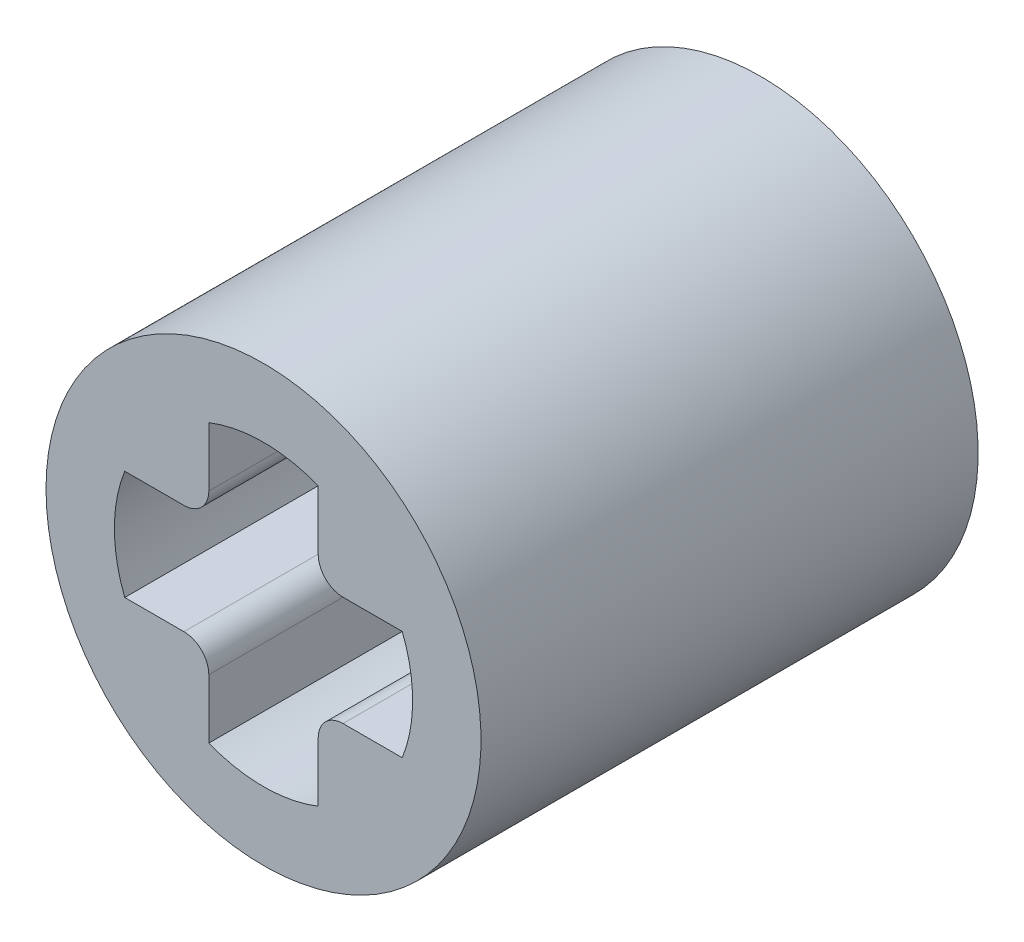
ISO-10303-21;
HEADER;
FILE_DESCRIPTION(('STEP AP214'),'2;1');
FILE_NAME('part.step','',(''),(''),'','','');
FILE_SCHEMA(('AUTOMOTIVE_DESIGN { 1 0 10303 214 1 1 1 1 }'));
ENDSEC;
DATA;
#1=APPLICATION_CONTEXT('core data for automotive mechanical design processes');
#2=APPLICATION_PROTOCOL_DEFINITION('international standard','automotive_design',2000,#1);
#3=PRODUCT_CONTEXT('',#1,'mechanical');
#4=PRODUCT('Part','Part','',(#3));
#5=PRODUCT_RELATED_PRODUCT_CATEGORY('part','',(#4));
#6=PRODUCT_DEFINITION_FORMATION('','',#4);
#7=PRODUCT_DEFINITION_CONTEXT('part definition',#1,'design');
#8=PRODUCT_DEFINITION('design','',#6,#7);
#9=PRODUCT_DEFINITION_SHAPE('','',#8);
#10=(LENGTH_UNIT() NAMED_UNIT(*) SI_UNIT(.MILLI.,.METRE.));
#11=(NAMED_UNIT(*) PLANE_ANGLE_UNIT() SI_UNIT($,.RADIAN.));
#12=(NAMED_UNIT(*) SI_UNIT($,.STERADIAN.) SOLID_ANGLE_UNIT());
#13=UNCERTAINTY_MEASURE_WITH_UNIT(LENGTH_MEASURE(1.E-05),#10,'distance_accuracy_value','');
#14=(GEOMETRIC_REPRESENTATION_CONTEXT(3) GLOBAL_UNCERTAINTY_ASSIGNED_CONTEXT((#13)) GLOBAL_UNIT_ASSIGNED_CONTEXT((#10,
#11,#12)) REPRESENTATION_CONTEXT('',''));
#15=CARTESIAN_POINT('',(0.,0.,0.));
#16=DIRECTION('',(0.,0.,1.));
#17=DIRECTION('',(1.,0.,0.));
#18=AXIS2_PLACEMENT_3D('',#15,#16,#17);
#19=CARTESIAN_POINT('',(-1.99133795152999,0.54112618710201,8.));
#20=DIRECTION('',(0.,0.,-1.));
#21=DIRECTION('',(-1.,0.,0.));
#22=AXIS2_PLACEMENT_3D('',#19,#20,#21);
#23=CYLINDRICAL_SURFACE('',#22,2.4);
#24=CARTESIAN_POINT('',(-1.99133795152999,0.54112618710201,8.));
#25=DIRECTION('',(0.,0.,-1.));
#26=DIRECTION('',(-1.,0.,0.));
#27=AXIS2_PLACEMENT_3D('',#24,#25,#26);
#28=CIRCLE('',#27,2.4);
#29=CARTESIAN_POINT('',(-4.22418366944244,-0.33887381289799,8.));
#30=VERTEX_POINT('',#29);
#31=CARTESIAN_POINT('',(-4.22418366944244,1.42112618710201,8.));
#32=VERTEX_POINT('',#31);
#33=EDGE_CURVE('E127',#30,#32,#28,.T.);
#34=ORIENTED_EDGE('',*,*,#33,.F.);
#35=DIRECTION('',(0.,0.,1.));
#36=VECTOR('',#35,1.);
#37=CARTESIAN_POINT('',(-4.22418366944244,-0.33887381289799,8.));
#38=LINE('',#37,#36);
#39=CARTESIAN_POINT('',(-4.22418366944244,-0.33887381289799,0.));
#40=VERTEX_POINT('',#39);
#41=EDGE_CURVE('E141',#40,#30,#38,.T.);
#42=ORIENTED_EDGE('',*,*,#41,.F.);
#43=CARTESIAN_POINT('',(-1.99133795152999,0.54112618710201,0.));
#44=DIRECTION('',(0.,0.,-1.));
#45=DIRECTION('',(-1.,0.,0.));
#46=AXIS2_PLACEMENT_3D('',#43,#44,#45);
#47=CIRCLE('',#46,2.4);
#48=CARTESIAN_POINT('',(-4.22418366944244,1.42112618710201,0.));
#49=VERTEX_POINT('',#48);
#50=EDGE_CURVE('E20',#49,#40,#47,.F.);
#51=ORIENTED_EDGE('',*,*,#50,.F.);
#52=DIRECTION('',(0.,0.,1.));
#53=VECTOR('',#52,1.);
#54=CARTESIAN_POINT('',(-4.22418366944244,1.42112618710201,8.));
#55=LINE('',#54,#53);
#56=EDGE_CURVE('E153',#32,#49,#55,.F.);
#57=ORIENTED_EDGE('',*,*,#56,.F.);
#58=EDGE_LOOP('',(#34,#42,#51,#57));
#59=FACE_BOUND('',#58,.T.);
#60=ADVANCED_FACE('F17',(#59),#23,.F.);
#61=CARTESIAN_POINT('',(-4.22418366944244,-0.33887381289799,8.));
#62=DIRECTION('',(0.,1.,0.));
#63=DIRECTION('',(-1.,0.,0.));
#64=AXIS2_PLACEMENT_3D('',#61,#62,#63);
#65=PLANE('',#64);
#66=DIRECTION('',(-1.,0.,0.));
#67=VECTOR('',#66,1.);
#68=CARTESIAN_POINT('',(-4.22418366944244,-0.33887381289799,8.));
#69=LINE('',#68,#67);
#70=CARTESIAN_POINT('',(-3.27133795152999,-0.33887381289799,8.));
#71=VERTEX_POINT('',#70);
#72=EDGE_CURVE('E143',#30,#71,#69,.F.);
#73=ORIENTED_EDGE('',*,*,#72,.T.);
#74=DIRECTION('',(0.,0.,-1.));
#75=VECTOR('',#74,1.);
#76=CARTESIAN_POINT('',(-3.27133795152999,-0.33887381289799,8.));
#77=LINE('',#76,#75);
#78=CARTESIAN_POINT('',(-3.27133795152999,-0.33887381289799,0.));
#79=VERTEX_POINT('',#78);
#80=EDGE_CURVE('E147',#79,#71,#77,.F.);
#81=ORIENTED_EDGE('',*,*,#80,.F.);
#82=DIRECTION('',(-1.,0.,0.));
#83=VECTOR('',#82,1.);
#84=CARTESIAN_POINT('',(-4.22418366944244,-0.33887381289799,0.));
#85=LINE('',#84,#83);
#86=EDGE_CURVE('E135',#79,#40,#85,.T.);
#87=ORIENTED_EDGE('',*,*,#86,.T.);
#88=ORIENTED_EDGE('',*,*,#41,.T.);
#89=EDGE_LOOP('',(#73,#81,#87,#88));
#90=FACE_BOUND('',#89,.T.);
#91=ADVANCED_FACE('F145',(#90),#65,.T.);
#92=CARTESIAN_POINT('',(-3.27133795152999,1.42112618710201,8.));
#93=DIRECTION('',(0.,-1.,0.));
#94=DIRECTION('',(1.,0.,0.));
#95=AXIS2_PLACEMENT_3D('',#92,#93,#94);
#96=PLANE('',#95);
#97=DIRECTION('',(1.,0.,0.));
#98=VECTOR('',#97,1.);
#99=CARTESIAN_POINT('',(-3.27133795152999,1.42112618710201,8.));
#100=LINE('',#99,#98);
#101=CARTESIAN_POINT('',(-3.27133795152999,1.42112618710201,8.));
#102=VERTEX_POINT('',#101);
#103=EDGE_CURVE('E155',#102,#32,#100,.F.);
#104=ORIENTED_EDGE('',*,*,#103,.T.);
#105=ORIENTED_EDGE('',*,*,#56,.T.);
#106=DIRECTION('',(1.,0.,0.));
#107=VECTOR('',#106,1.);
#108=CARTESIAN_POINT('',(-3.27133795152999,1.42112618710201,0.));
#109=LINE('',#108,#107);
#110=CARTESIAN_POINT('',(-3.27133795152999,1.42112618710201,0.));
#111=VERTEX_POINT('',#110);
#112=EDGE_CURVE('E138',#49,#111,#109,.T.);
#113=ORIENTED_EDGE('',*,*,#112,.T.);
#114=DIRECTION('',(0.,0.,-1.));
#115=VECTOR('',#114,1.);
#116=CARTESIAN_POINT('',(-3.27133795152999,1.42112618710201,8.));
#117=LINE('',#116,#115);
#118=EDGE_CURVE('E184',#102,#111,#117,.T.);
#119=ORIENTED_EDGE('',*,*,#118,.F.);
#120=EDGE_LOOP('',(#104,#105,#113,#119));
#121=FACE_BOUND('',#120,.T.);
#122=ADVANCED_FACE('F288',(#121),#96,.T.);
#123=CARTESIAN_POINT('',(-0.711337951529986,-0.73887381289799,8.));
#124=DIRECTION('',(0.,0.,-1.));
#125=DIRECTION('',(-1.,0.,0.));
#126=AXIS2_PLACEMENT_3D('',#123,#124,#125);
#127=CYLINDRICAL_SURFACE('',#126,0.4);
#128=CARTESIAN_POINT('',(-0.711337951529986,-0.73887381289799,8.));
#129=DIRECTION('',(0.,0.,-1.));
#130=DIRECTION('',(-1.,0.,0.));
#131=AXIS2_PLACEMENT_3D('',#128,#129,#130);
#132=CIRCLE('',#131,0.4);
#133=CARTESIAN_POINT('',(-1.11133795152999,-0.738873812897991,8.));
#134=VERTEX_POINT('',#133);
#135=CARTESIAN_POINT('',(-0.711337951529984,-0.33887381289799,8.));
#136=VERTEX_POINT('',#135);
#137=EDGE_CURVE('E195',#134,#136,#132,.T.);
#138=ORIENTED_EDGE('',*,*,#137,.T.);
#139=DIRECTION('',(0.,0.,1.));
#140=VECTOR('',#139,1.);
#141=CARTESIAN_POINT('',(-0.711337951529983,-0.33887381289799,8.));
#142=LINE('',#141,#140);
#143=CARTESIAN_POINT('',(-0.711337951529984,-0.33887381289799,0.));
#144=VERTEX_POINT('',#143);
#145=EDGE_CURVE('E206',#144,#136,#142,.T.);
#146=ORIENTED_EDGE('',*,*,#145,.F.);
#147=CARTESIAN_POINT('',(-0.711337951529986,-0.73887381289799,0.));
#148=DIRECTION('',(0.,0.,-1.));
#149=DIRECTION('',(-1.,0.,0.));
#150=AXIS2_PLACEMENT_3D('',#147,#148,#149);
#151=CIRCLE('',#150,0.4);
#152=CARTESIAN_POINT('',(-1.11133795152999,-0.738873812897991,0.));
#153=VERTEX_POINT('',#152);
#154=EDGE_CURVE('E154',#144,#153,#151,.F.);
#155=ORIENTED_EDGE('',*,*,#154,.T.);
#156=DIRECTION('',(0.,0.,1.));
#157=VECTOR('',#156,1.);
#158=CARTESIAN_POINT('',(-1.11133795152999,-0.738873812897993,8.));
#159=LINE('',#158,#157);
#160=EDGE_CURVE('E203',#134,#153,#159,.F.);
#161=ORIENTED_EDGE('',*,*,#160,.F.);
#162=EDGE_LOOP('',(#138,#146,#155,#161));
#163=FACE_BOUND('',#162,.T.);
#164=ADVANCED_FACE('F202',(#163),#127,.T.);
#165=CARTESIAN_POINT('',(-3.27133795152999,-0.73887381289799,8.));
#166=DIRECTION('',(0.,0.,-1.));
#167=DIRECTION('',(-1.,0.,0.));
#168=AXIS2_PLACEMENT_3D('',#165,#166,#167);
#169=CYLINDRICAL_SURFACE('',#168,0.4);
#170=CARTESIAN_POINT('',(-3.27133795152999,-0.73887381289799,8.));
#171=DIRECTION('',(0.,0.,-1.));
#172=DIRECTION('',(-1.,0.,0.));
#173=AXIS2_PLACEMENT_3D('',#170,#171,#172);
#174=CIRCLE('',#173,0.4);
#175=CARTESIAN_POINT('',(-2.87133795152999,-0.738873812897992,8.));
#176=VERTEX_POINT('',#175);
#177=EDGE_CURVE('E191',#71,#176,#174,.T.);
#178=ORIENTED_EDGE('',*,*,#177,.T.);
#179=DIRECTION('',(0.,0.,-1.));
#180=VECTOR('',#179,1.);
#181=CARTESIAN_POINT('',(-2.87133795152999,-0.738873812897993,8.));
#182=LINE('',#181,#180);
#183=CARTESIAN_POINT('',(-2.87133795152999,-0.738873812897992,0.));
#184=VERTEX_POINT('',#183);
#185=EDGE_CURVE('E217',#184,#176,#182,.F.);
#186=ORIENTED_EDGE('',*,*,#185,.F.);
#187=CARTESIAN_POINT('',(-3.27133795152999,-0.73887381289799,0.));
#188=DIRECTION('',(0.,0.,-1.));
#189=DIRECTION('',(-1.,0.,0.));
#190=AXIS2_PLACEMENT_3D('',#187,#188,#189);
#191=CIRCLE('',#190,0.4);
#192=EDGE_CURVE('E193',#184,#79,#191,.F.);
#193=ORIENTED_EDGE('',*,*,#192,.T.);
#194=ORIENTED_EDGE('',*,*,#80,.T.);
#195=EDGE_LOOP('',(#178,#186,#193,#194));
#196=FACE_BOUND('',#195,.T.);
#197=ADVANCED_FACE('F235',(#196),#169,.T.);
#198=CARTESIAN_POINT('',(-3.27133795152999,1.82112618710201,8.));
#199=DIRECTION('',(0.,0.,-1.));
#200=DIRECTION('',(-1.,0.,0.));
#201=AXIS2_PLACEMENT_3D('',#198,#199,#200);
#202=CYLINDRICAL_SURFACE('',#201,0.4);
#203=CARTESIAN_POINT('',(-3.27133795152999,1.82112618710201,8.));
#204=DIRECTION('',(0.,0.,-1.));
#205=DIRECTION('',(-1.,0.,0.));
#206=AXIS2_PLACEMENT_3D('',#203,#204,#205);
#207=CIRCLE('',#206,0.4);
#208=CARTESIAN_POINT('',(-2.87133795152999,1.82112618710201,8.));
#209=VERTEX_POINT('',#208);
#210=EDGE_CURVE('E185',#209,#102,#207,.T.);
#211=ORIENTED_EDGE('',*,*,#210,.T.);
#212=ORIENTED_EDGE('',*,*,#118,.T.);
#213=CARTESIAN_POINT('',(-3.27133795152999,1.82112618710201,0.));
#214=DIRECTION('',(0.,0.,-1.));
#215=DIRECTION('',(-1.,0.,0.));
#216=AXIS2_PLACEMENT_3D('',#213,#214,#215);
#217=CIRCLE('',#216,0.4);
#218=CARTESIAN_POINT('',(-2.87133795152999,1.82112618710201,0.));
#219=VERTEX_POINT('',#218);
#220=EDGE_CURVE('E188',#111,#219,#217,.F.);
#221=ORIENTED_EDGE('',*,*,#220,.T.);
#222=DIRECTION('',(0.,0.,-1.));
#223=VECTOR('',#222,1.);
#224=CARTESIAN_POINT('',(-2.87133795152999,1.82112618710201,8.));
#225=LINE('',#224,#223);
#226=EDGE_CURVE('E268',#209,#219,#225,.T.);
#227=ORIENTED_EDGE('',*,*,#226,.F.);
#228=EDGE_LOOP('',(#211,#212,#221,#227));
#229=FACE_BOUND('',#228,.T.);
#230=ADVANCED_FACE('F284',(#229),#202,.T.);
#231=CARTESIAN_POINT('',(-0.711337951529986,1.82112618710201,8.));
#232=DIRECTION('',(0.,0.,-1.));
#233=DIRECTION('',(-1.,0.,0.));
#234=AXIS2_PLACEMENT_3D('',#231,#232,#233);
#235=CYLINDRICAL_SURFACE('',#234,0.4);
#236=CARTESIAN_POINT('',(-0.711337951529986,1.82112618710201,8.));
#237=DIRECTION('',(0.,0.,-1.));
#238=DIRECTION('',(-1.,0.,0.));
#239=AXIS2_PLACEMENT_3D('',#236,#237,#238);
#240=CIRCLE('',#239,0.4);
#241=CARTESIAN_POINT('',(-0.711337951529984,1.42112618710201,8.));
#242=VERTEX_POINT('',#241);
#243=CARTESIAN_POINT('',(-1.11133795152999,1.82112618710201,8.));
#244=VERTEX_POINT('',#243);
#245=EDGE_CURVE('E178',#242,#244,#240,.T.);
#246=ORIENTED_EDGE('',*,*,#245,.T.);
#247=DIRECTION('',(0.,0.,1.));
#248=VECTOR('',#247,1.);
#249=CARTESIAN_POINT('',(-1.11133795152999,1.82112618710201,8.));
#250=LINE('',#249,#248);
#251=CARTESIAN_POINT('',(-1.11133795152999,1.82112618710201,0.));
#252=VERTEX_POINT('',#251);
#253=EDGE_CURVE('E264',#252,#244,#250,.T.);
#254=ORIENTED_EDGE('',*,*,#253,.F.);
#255=CARTESIAN_POINT('',(-0.711337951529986,1.82112618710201,0.));
#256=DIRECTION('',(0.,0.,-1.));
#257=DIRECTION('',(-1.,0.,0.));
#258=AXIS2_PLACEMENT_3D('',#255,#256,#257);
#259=CIRCLE('',#258,0.4);
#260=CARTESIAN_POINT('',(-0.711337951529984,1.42112618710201,0.));
#261=VERTEX_POINT('',#260);
#262=EDGE_CURVE('E181',#252,#261,#259,.F.);
#263=ORIENTED_EDGE('',*,*,#262,.T.);
#264=DIRECTION('',(0.,0.,1.));
#265=VECTOR('',#264,1.);
#266=CARTESIAN_POINT('',(-0.711337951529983,1.42112618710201,8.));
#267=LINE('',#266,#265);
#268=EDGE_CURVE('E226',#242,#261,#267,.F.);
#269=ORIENTED_EDGE('',*,*,#268,.F.);
#270=EDGE_LOOP('',(#246,#254,#263,#269));
#271=FACE_BOUND('',#270,.T.);
#272=ADVANCED_FACE('F305',(#271),#235,.T.);
#273=CARTESIAN_POINT('',(0.241507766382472,1.42112618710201,8.));
#274=DIRECTION('',(0.,-1.,0.));
#275=DIRECTION('',(1.,0.,0.));
#276=AXIS2_PLACEMENT_3D('',#273,#274,#275);
#277=PLANE('',#276);
#278=DIRECTION('',(1.,0.,0.));
#279=VECTOR('',#278,1.);
#280=CARTESIAN_POINT('',(0.241507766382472,1.42112618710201,8.));
#281=LINE('',#280,#279);
#282=CARTESIAN_POINT('',(0.241507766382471,1.42112618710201,8.));
#283=VERTEX_POINT('',#282);
#284=EDGE_CURVE('E229',#283,#242,#281,.F.);
#285=ORIENTED_EDGE('',*,*,#284,.T.);
#286=ORIENTED_EDGE('',*,*,#268,.T.);
#287=DIRECTION('',(1.,0.,0.));
#288=VECTOR('',#287,1.);
#289=CARTESIAN_POINT('',(0.241507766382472,1.42112618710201,0.));
#290=LINE('',#289,#288);
#291=CARTESIAN_POINT('',(0.241507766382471,1.42112618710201,0.));
#292=VERTEX_POINT('',#291);
#293=EDGE_CURVE('E180',#261,#292,#290,.T.);
#294=ORIENTED_EDGE('',*,*,#293,.T.);
#295=DIRECTION('',(0.,0.,-1.));
#296=VECTOR('',#295,1.);
#297=CARTESIAN_POINT('',(0.241507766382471,1.42112618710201,8.));
#298=LINE('',#297,#296);
#299=EDGE_CURVE('E256',#292,#283,#298,.F.);
#300=ORIENTED_EDGE('',*,*,#299,.T.);
#301=EDGE_LOOP('',(#285,#286,#294,#300));
#302=FACE_BOUND('',#301,.T.);
#303=ADVANCED_FACE('F302',(#302),#277,.T.);
#304=CARTESIAN_POINT('',(-0.711337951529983,-0.33887381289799,8.));
#305=DIRECTION('',(0.,1.,0.));
#306=DIRECTION('',(0.,0.,1.));
#307=AXIS2_PLACEMENT_3D('',#304,#305,#306);
#308=PLANE('',#307);
#309=DIRECTION('',(1.,0.,0.));
#310=VECTOR('',#309,1.);
#311=CARTESIAN_POINT('',(-0.711337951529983,-0.33887381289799,8.));
#312=LINE('',#311,#310);
#313=CARTESIAN_POINT('',(0.241507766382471,-0.33887381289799,8.));
#314=VERTEX_POINT('',#313);
#315=EDGE_CURVE('E224',#136,#314,#312,.T.);
#316=ORIENTED_EDGE('',*,*,#315,.T.);
#317=DIRECTION('',(0.,0.,-1.));
#318=VECTOR('',#317,1.);
#319=CARTESIAN_POINT('',(0.241507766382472,-0.338873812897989,8.));
#320=LINE('',#319,#318);
#321=CARTESIAN_POINT('',(0.241507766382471,-0.33887381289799,0.));
#322=VERTEX_POINT('',#321);
#323=EDGE_CURVE('E253',#314,#322,#320,.T.);
#324=ORIENTED_EDGE('',*,*,#323,.T.);
#325=DIRECTION('',(1.,0.,0.));
#326=VECTOR('',#325,1.);
#327=CARTESIAN_POINT('',(-0.711337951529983,-0.33887381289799,0.));
#328=LINE('',#327,#326);
#329=EDGE_CURVE('E225',#322,#144,#328,.F.);
#330=ORIENTED_EDGE('',*,*,#329,.T.);
#331=ORIENTED_EDGE('',*,*,#145,.T.);
#332=EDGE_LOOP('',(#316,#324,#330,#331));
#333=FACE_BOUND('',#332,.T.);
#334=ADVANCED_FACE('F296',(#333),#308,.T.);
#335=CARTESIAN_POINT('',(-1.11133795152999,-1.69171953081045,8.));
#336=DIRECTION('',(-1.,0.,0.));
#337=DIRECTION('',(0.,0.,1.));
#338=AXIS2_PLACEMENT_3D('',#335,#336,#337);
#339=PLANE('',#338);
#340=DIRECTION('',(0.,1.,0.));
#341=VECTOR('',#340,1.);
#342=CARTESIAN_POINT('',(-1.11133795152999,-1.69171953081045,8.));
#343=LINE('',#342,#341);
#344=CARTESIAN_POINT('',(-1.11133795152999,-1.69171953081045,8.));
#345=VERTEX_POINT('',#344);
#346=EDGE_CURVE('E213',#345,#134,#343,.T.);
#347=ORIENTED_EDGE('',*,*,#346,.T.);
#348=ORIENTED_EDGE('',*,*,#160,.T.);
#349=DIRECTION('',(0.,1.,0.));
#350=VECTOR('',#349,1.);
#351=CARTESIAN_POINT('',(-1.11133795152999,-1.69171953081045,0.));
#352=LINE('',#351,#350);
#353=CARTESIAN_POINT('',(-1.11133795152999,-1.69171953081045,0.));
#354=VERTEX_POINT('',#353);
#355=EDGE_CURVE('E211',#153,#354,#352,.F.);
#356=ORIENTED_EDGE('',*,*,#355,.T.);
#357=DIRECTION('',(0.,0.,-1.));
#358=VECTOR('',#357,1.);
#359=CARTESIAN_POINT('',(-1.11133795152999,-1.69171953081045,8.));
#360=LINE('',#359,#358);
#361=EDGE_CURVE('E250',#354,#345,#360,.F.);
#362=ORIENTED_EDGE('',*,*,#361,.T.);
#363=EDGE_LOOP('',(#347,#348,#356,#362));
#364=FACE_BOUND('',#363,.T.);
#365=ADVANCED_FACE('F209',(#364),#339,.T.);
#366=CARTESIAN_POINT('',(-2.87133795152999,-0.738873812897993,8.));
#367=DIRECTION('',(1.,0.,0.));
#368=DIRECTION('',(0.,0.,-1.));
#369=AXIS2_PLACEMENT_3D('',#366,#367,#368);
#370=PLANE('',#369);
#371=DIRECTION('',(0.,1.,0.));
#372=VECTOR('',#371,1.);
#373=CARTESIAN_POINT('',(-2.87133795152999,-0.738873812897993,8.));
#374=LINE('',#373,#372);
#375=CARTESIAN_POINT('',(-2.87133795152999,-1.69171953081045,8.));
#376=VERTEX_POINT('',#375);
#377=EDGE_CURVE('E246',#176,#376,#374,.F.);
#378=ORIENTED_EDGE('',*,*,#377,.T.);
#379=DIRECTION('',(0.,0.,-1.));
#380=VECTOR('',#379,1.);
#381=CARTESIAN_POINT('',(-2.87133795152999,-1.69171953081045,8.));
#382=LINE('',#381,#380);
#383=CARTESIAN_POINT('',(-2.87133795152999,-1.69171953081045,0.));
#384=VERTEX_POINT('',#383);
#385=EDGE_CURVE('E244',#376,#384,#382,.T.);
#386=ORIENTED_EDGE('',*,*,#385,.T.);
#387=DIRECTION('',(0.,1.,0.));
#388=VECTOR('',#387,1.);
#389=CARTESIAN_POINT('',(-2.87133795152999,-0.738873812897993,0.));
#390=LINE('',#389,#388);
#391=EDGE_CURVE('E214',#384,#184,#390,.T.);
#392=ORIENTED_EDGE('',*,*,#391,.T.);
#393=ORIENTED_EDGE('',*,*,#185,.T.);
#394=EDGE_LOOP('',(#378,#386,#392,#393));
#395=FACE_BOUND('',#394,.T.);
#396=ADVANCED_FACE('F245',(#395),#370,.T.);
#397=CARTESIAN_POINT('',(-2.87133795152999,2.77397190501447,8.));
#398=DIRECTION('',(1.,0.,0.));
#399=DIRECTION('',(0.,0.,-1.));
#400=AXIS2_PLACEMENT_3D('',#397,#398,#399);
#401=PLANE('',#400);
#402=DIRECTION('',(0.,1.,0.));
#403=VECTOR('',#402,1.);
#404=CARTESIAN_POINT('',(-2.87133795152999,2.77397190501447,8.));
#405=LINE('',#404,#403);
#406=CARTESIAN_POINT('',(-2.87133795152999,2.77397190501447,8.));
#407=VERTEX_POINT('',#406);
#408=EDGE_CURVE('E270',#407,#209,#405,.F.);
#409=ORIENTED_EDGE('',*,*,#408,.T.);
#410=ORIENTED_EDGE('',*,*,#226,.T.);
#411=DIRECTION('',(0.,1.,0.));
#412=VECTOR('',#411,1.);
#413=CARTESIAN_POINT('',(-2.87133795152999,2.77397190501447,0.));
#414=LINE('',#413,#412);
#415=CARTESIAN_POINT('',(-2.87133795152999,2.77397190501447,0.));
#416=VERTEX_POINT('',#415);
#417=EDGE_CURVE('E35',#219,#416,#414,.T.);
#418=ORIENTED_EDGE('',*,*,#417,.T.);
#419=DIRECTION('',(0.,0.,-1.));
#420=VECTOR('',#419,1.);
#421=CARTESIAN_POINT('',(-2.87133795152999,2.77397190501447,8.));
#422=LINE('',#421,#420);
#423=EDGE_CURVE('E249',#416,#407,#422,.F.);
#424=ORIENTED_EDGE('',*,*,#423,.T.);
#425=EDGE_LOOP('',(#409,#410,#418,#424));
#426=FACE_BOUND('',#425,.T.);
#427=ADVANCED_FACE('F282',(#426),#401,.T.);
#428=CARTESIAN_POINT('',(-1.11133795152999,1.82112618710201,8.));
#429=DIRECTION('',(-1.,0.,0.));
#430=DIRECTION('',(0.,0.,1.));
#431=AXIS2_PLACEMENT_3D('',#428,#429,#430);
#432=PLANE('',#431);
#433=DIRECTION('',(0.,1.,0.));
#434=VECTOR('',#433,1.);
#435=CARTESIAN_POINT('',(-1.11133795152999,1.82112618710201,8.));
#436=LINE('',#435,#434);
#437=CARTESIAN_POINT('',(-1.11133795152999,2.77397190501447,8.));
#438=VERTEX_POINT('',#437);
#439=EDGE_CURVE('E262',#244,#438,#436,.T.);
#440=ORIENTED_EDGE('',*,*,#439,.T.);
#441=DIRECTION('',(0.,0.,-1.));
#442=VECTOR('',#441,1.);
#443=CARTESIAN_POINT('',(-1.11133795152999,2.77397190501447,8.));
#444=LINE('',#443,#442);
#445=CARTESIAN_POINT('',(-1.11133795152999,2.77397190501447,0.));
#446=VERTEX_POINT('',#445);
#447=EDGE_CURVE('E177',#438,#446,#444,.T.);
#448=ORIENTED_EDGE('',*,*,#447,.T.);
#449=DIRECTION('',(0.,1.,0.));
#450=VECTOR('',#449,1.);
#451=CARTESIAN_POINT('',(-1.11133795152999,1.82112618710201,0.));
#452=LINE('',#451,#450);
#453=EDGE_CURVE('E265',#446,#252,#452,.F.);
#454=ORIENTED_EDGE('',*,*,#453,.T.);
#455=ORIENTED_EDGE('',*,*,#253,.T.);
#456=EDGE_LOOP('',(#440,#448,#454,#455));
#457=FACE_BOUND('',#456,.T.);
#458=ADVANCED_FACE('F311',(#457),#432,.T.);
#459=CARTESIAN_POINT('',(-1.99133795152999,0.54112618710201,8.));
#460=DIRECTION('',(0.,0.,-1.));
#461=DIRECTION('',(-1.,0.,0.));
#462=AXIS2_PLACEMENT_3D('',#459,#460,#461);
#463=CYLINDRICAL_SURFACE('',#462,2.4);
#464=ORIENTED_EDGE('',*,*,#323,.F.);
#465=CARTESIAN_POINT('',(-1.99133795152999,0.54112618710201,8.));
#466=DIRECTION('',(0.,0.,-1.));
#467=DIRECTION('',(-1.,0.,0.));
#468=AXIS2_PLACEMENT_3D('',#465,#466,#467);
#469=CIRCLE('',#468,2.4);
#470=EDGE_CURVE('E171',#283,#314,#469,.T.);
#471=ORIENTED_EDGE('',*,*,#470,.F.);
#472=ORIENTED_EDGE('',*,*,#299,.F.);
#473=CARTESIAN_POINT('',(-1.99133795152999,0.54112618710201,0.));
#474=DIRECTION('',(0.,0.,-1.));
#475=DIRECTION('',(-1.,0.,0.));
#476=AXIS2_PLACEMENT_3D('',#473,#474,#475);
#477=CIRCLE('',#476,2.4);
#478=EDGE_CURVE('E165',#292,#322,#477,.T.);
#479=ORIENTED_EDGE('',*,*,#478,.T.);
#480=EDGE_LOOP('',(#464,#471,#472,#479));
#481=FACE_BOUND('',#480,.T.);
#482=ADVANCED_FACE('F300',(#481),#463,.F.);
#483=CARTESIAN_POINT('',(-1.99133795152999,0.54112618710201,8.));
#484=DIRECTION('',(0.,0.,-1.));
#485=DIRECTION('',(-1.,0.,0.));
#486=AXIS2_PLACEMENT_3D('',#483,#484,#485);
#487=CYLINDRICAL_SURFACE('',#486,2.4);
#488=ORIENTED_EDGE('',*,*,#385,.F.);
#489=CARTESIAN_POINT('',(-1.99133795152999,0.54112618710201,8.));
#490=DIRECTION('',(0.,0.,-1.));
#491=DIRECTION('',(-1.,0.,0.));
#492=AXIS2_PLACEMENT_3D('',#489,#490,#491);
#493=CIRCLE('',#492,2.4);
#494=EDGE_CURVE('E168',#345,#376,#493,.T.);
#495=ORIENTED_EDGE('',*,*,#494,.F.);
#496=ORIENTED_EDGE('',*,*,#361,.F.);
#497=CARTESIAN_POINT('',(-1.99133795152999,0.54112618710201,0.));
#498=DIRECTION('',(0.,0.,-1.));
#499=DIRECTION('',(-1.,0.,0.));
#500=AXIS2_PLACEMENT_3D('',#497,#498,#499);
#501=CIRCLE('',#500,2.4);
#502=EDGE_CURVE('E162',#354,#384,#501,.T.);
#503=ORIENTED_EDGE('',*,*,#502,.T.);
#504=EDGE_LOOP('',(#488,#495,#496,#503));
#505=FACE_BOUND('',#504,.T.);
#506=ADVANCED_FACE('F252',(#505),#487,.F.);
#507=CARTESIAN_POINT('',(-1.99133795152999,0.54112618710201,8.));
#508=DIRECTION('',(0.,0.,-1.));
#509=DIRECTION('',(-1.,0.,0.));
#510=AXIS2_PLACEMENT_3D('',#507,#508,#509);
#511=CYLINDRICAL_SURFACE('',#510,2.4);
#512=ORIENTED_EDGE('',*,*,#447,.F.);
#513=CARTESIAN_POINT('',(-1.99133795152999,0.54112618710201,8.));
#514=DIRECTION('',(0.,0.,-1.));
#515=DIRECTION('',(-1.,0.,0.));
#516=AXIS2_PLACEMENT_3D('',#513,#514,#515);
#517=CIRCLE('',#516,2.4);
#518=EDGE_CURVE('E174',#407,#438,#517,.T.);
#519=ORIENTED_EDGE('',*,*,#518,.F.);
#520=ORIENTED_EDGE('',*,*,#423,.F.);
#521=CARTESIAN_POINT('',(-1.99133795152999,0.54112618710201,0.));
#522=DIRECTION('',(0.,0.,-1.));
#523=DIRECTION('',(-1.,0.,0.));
#524=AXIS2_PLACEMENT_3D('',#521,#522,#523);
#525=CIRCLE('',#524,2.4);
#526=EDGE_CURVE('E159',#416,#446,#525,.T.);
#527=ORIENTED_EDGE('',*,*,#526,.T.);
#528=EDGE_LOOP('',(#512,#519,#520,#527));
#529=FACE_BOUND('',#528,.T.);
#530=ADVANCED_FACE('F315',(#529),#511,.F.);
#531=CARTESIAN_POINT('',(-1.99133795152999,0.54112618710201,8.));
#532=DIRECTION('',(0.,0.,1.));
#533=DIRECTION('',(1.,0.,0.));
#534=AXIS2_PLACEMENT_3D('',#531,#532,#533);
#535=PLANE('',#534);
#536=ORIENTED_EDGE('',*,*,#103,.F.);
#537=ORIENTED_EDGE('',*,*,#210,.F.);
#538=ORIENTED_EDGE('',*,*,#408,.F.);
#539=ORIENTED_EDGE('',*,*,#518,.T.);
#540=ORIENTED_EDGE('',*,*,#439,.F.);
#541=ORIENTED_EDGE('',*,*,#245,.F.);
#542=ORIENTED_EDGE('',*,*,#284,.F.);
#543=ORIENTED_EDGE('',*,*,#470,.T.);
#544=ORIENTED_EDGE('',*,*,#315,.F.);
#545=ORIENTED_EDGE('',*,*,#137,.F.);
#546=ORIENTED_EDGE('',*,*,#346,.F.);
#547=ORIENTED_EDGE('',*,*,#494,.T.);
#548=ORIENTED_EDGE('',*,*,#377,.F.);
#549=ORIENTED_EDGE('',*,*,#177,.F.);
#550=ORIENTED_EDGE('',*,*,#72,.F.);
#551=ORIENTED_EDGE('',*,*,#33,.T.);
#552=EDGE_LOOP('',(#536,#537,#538,#539,#540,#541,#542,#543,#544,#545,#546,#547,#548,#549,#550,#551));
#553=FACE_BOUND('',#552,.T.);
#554=CARTESIAN_POINT('',(-1.99133795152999,0.54112618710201,8.));
#555=DIRECTION('',(0.,0.,-1.));
#556=DIRECTION('',(-1.,0.,0.));
#557=AXIS2_PLACEMENT_3D('',#554,#555,#556);
#558=CIRCLE('',#557,3.5);
#559=CARTESIAN_POINT('',(-5.49133795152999,0.54112618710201,8.));
#560=VERTEX_POINT('',#559);
#561=EDGE_CURVE('E26',#560,#560,#558,.T.);
#562=ORIENTED_EDGE('',*,*,#561,.F.);
#563=EDGE_LOOP('',(#562));
#564=FACE_BOUND('',#563,.T.);
#565=ADVANCED_FACE('F290',(#553,#564),#535,.T.);
#566=CARTESIAN_POINT('',(-1.99133795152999,0.54112618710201,0.));
#567=DIRECTION('',(0.,0.,1.));
#568=DIRECTION('',(1.,0.,0.));
#569=AXIS2_PLACEMENT_3D('',#566,#567,#568);
#570=PLANE('',#569);
#571=ORIENTED_EDGE('',*,*,#417,.F.);
#572=ORIENTED_EDGE('',*,*,#220,.F.);
#573=ORIENTED_EDGE('',*,*,#112,.F.);
#574=ORIENTED_EDGE('',*,*,#50,.T.);
#575=ORIENTED_EDGE('',*,*,#86,.F.);
#576=ORIENTED_EDGE('',*,*,#192,.F.);
#577=ORIENTED_EDGE('',*,*,#391,.F.);
#578=ORIENTED_EDGE('',*,*,#502,.F.);
#579=ORIENTED_EDGE('',*,*,#355,.F.);
#580=ORIENTED_EDGE('',*,*,#154,.F.);
#581=ORIENTED_EDGE('',*,*,#329,.F.);
#582=ORIENTED_EDGE('',*,*,#478,.F.);
#583=ORIENTED_EDGE('',*,*,#293,.F.);
#584=ORIENTED_EDGE('',*,*,#262,.F.);
#585=ORIENTED_EDGE('',*,*,#453,.F.);
#586=ORIENTED_EDGE('',*,*,#526,.F.);
#587=EDGE_LOOP('',(#571,#572,#573,#574,#575,#576,#577,#578,#579,#580,#581,#582,#583,#584,#585,#586));
#588=FACE_BOUND('',#587,.T.);
#589=CARTESIAN_POINT('',(-1.99133795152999,0.54112618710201,0.));
#590=DIRECTION('',(0.,0.,-1.));
#591=DIRECTION('',(-1.,0.,0.));
#592=AXIS2_PLACEMENT_3D('',#589,#590,#591);
#593=CIRCLE('',#592,3.5);
#594=CARTESIAN_POINT('',(-5.49133795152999,0.54112618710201,0.));
#595=VERTEX_POINT('',#594);
#596=EDGE_CURVE('E10',#595,#595,#593,.F.);
#597=ORIENTED_EDGE('',*,*,#596,.F.);
#598=EDGE_LOOP('',(#597));
#599=FACE_BOUND('',#598,.T.);
#600=ADVANCED_FACE('F132',(#588,#599),#570,.F.);
#601=CARTESIAN_POINT('',(-1.99133795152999,0.54112618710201,8.));
#602=DIRECTION('',(0.,0.,-1.));
#603=DIRECTION('',(-1.,0.,0.));
#604=AXIS2_PLACEMENT_3D('',#601,#602,#603);
#605=CYLINDRICAL_SURFACE('',#604,3.5);
#606=ORIENTED_EDGE('',*,*,#596,.T.);
#607=EDGE_LOOP('',(#606));
#608=FACE_BOUND('',#607,.T.);
#609=ORIENTED_EDGE('',*,*,#561,.T.);
#610=EDGE_LOOP('',(#609));
#611=FACE_BOUND('',#610,.T.);
#612=ADVANCED_FACE('F325',(#608,#611),#605,.T.);
#613=CLOSED_SHELL('',(#60,#91,#122,#164,#197,#230,#272,#303,#334,#365,#396,#427,#458,#482,#506,
#530,#565,#600,#612));
#614=MANIFOLD_SOLID_BREP('B1',#613);
#615=ADVANCED_BREP_SHAPE_REPRESENTATION('',(#18,#614),#14);
#616=SHAPE_DEFINITION_REPRESENTATION(#9,#615);
ENDSEC;
END-ISO-10303-21;
